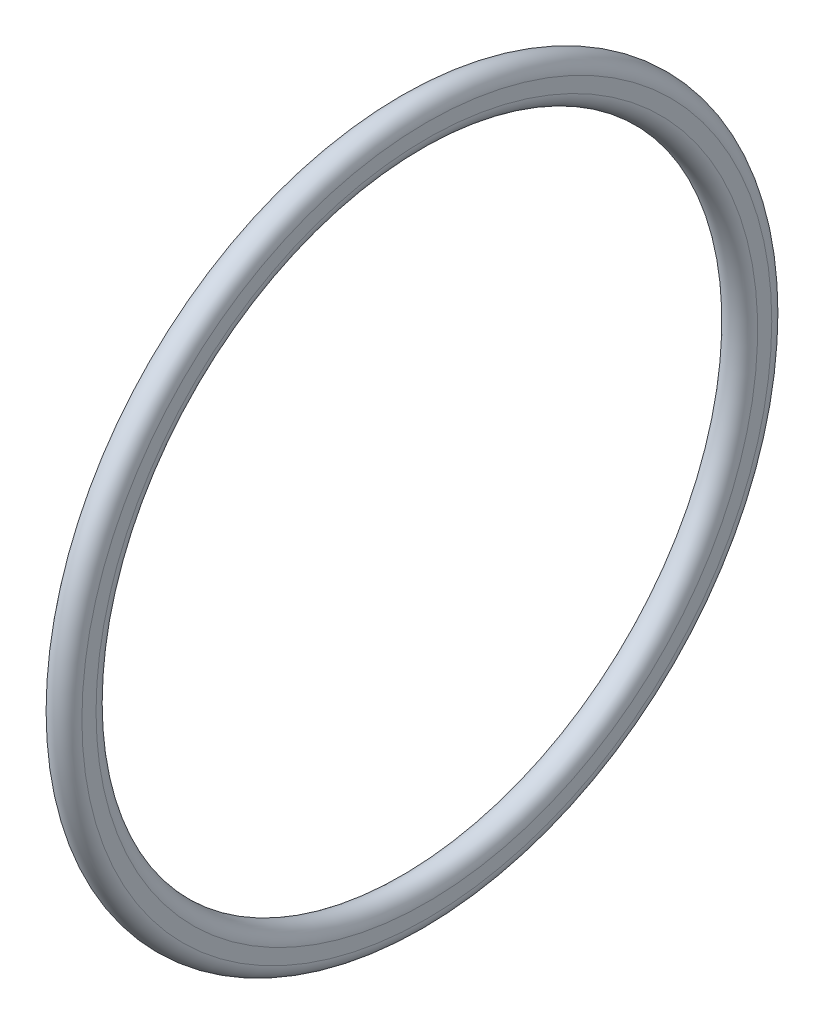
ISO-10303-21;
HEADER;
FILE_DESCRIPTION(('STEP AP214'),'2;1');
FILE_NAME('part.step','',(''),(''),'','','');
FILE_SCHEMA(('AUTOMOTIVE_DESIGN { 1 0 10303 214 1 1 1 1 }'));
ENDSEC;
DATA;
#1=APPLICATION_CONTEXT('core data for automotive mechanical design processes');
#2=APPLICATION_PROTOCOL_DEFINITION('international standard','automotive_design',2000,#1);
#3=PRODUCT_CONTEXT('',#1,'mechanical');
#4=PRODUCT('Part','Part','',(#3));
#5=PRODUCT_RELATED_PRODUCT_CATEGORY('part','',(#4));
#6=PRODUCT_DEFINITION_FORMATION('','',#4);
#7=PRODUCT_DEFINITION_CONTEXT('part definition',#1,'design');
#8=PRODUCT_DEFINITION('design','',#6,#7);
#9=PRODUCT_DEFINITION_SHAPE('','',#8);
#10=(LENGTH_UNIT() NAMED_UNIT(*) SI_UNIT(.MILLI.,.METRE.));
#11=(NAMED_UNIT(*) PLANE_ANGLE_UNIT() SI_UNIT($,.RADIAN.));
#12=(NAMED_UNIT(*) SI_UNIT($,.STERADIAN.) SOLID_ANGLE_UNIT());
#13=UNCERTAINTY_MEASURE_WITH_UNIT(LENGTH_MEASURE(1.E-05),#10,'distance_accuracy_value','');
#14=(GEOMETRIC_REPRESENTATION_CONTEXT(3) GLOBAL_UNCERTAINTY_ASSIGNED_CONTEXT((#13)) GLOBAL_UNIT_ASSIGNED_CONTEXT((#10,
#11,#12)) REPRESENTATION_CONTEXT('',''));
#15=CARTESIAN_POINT('',(0.,0.,0.));
#16=DIRECTION('',(0.,0.,1.));
#17=DIRECTION('',(1.,0.,0.));
#18=AXIS2_PLACEMENT_3D('',#15,#16,#17);
#19=CARTESIAN_POINT('',(0.,0.,0.));
#20=DIRECTION('',(-1.,0.,0.));
#21=DIRECTION('',(0.,0.,1.));
#22=AXIS2_PLACEMENT_3D('',#19,#20,#21);
#23=TOROIDAL_SURFACE('',#22,31.0007,1.3335);
#24=CARTESIAN_POINT('',(-1.3335,0.,0.));
#25=DIRECTION('',(-1.,0.,0.));
#26=DIRECTION('',(0.,0.,1.));
#27=AXIS2_PLACEMENT_3D('',#24,#25,#26);
#28=CIRCLE('',#27,31.0007);
#29=CARTESIAN_POINT('',(-1.3335,0.,31.0007));
#30=VERTEX_POINT('',#29);
#31=EDGE_CURVE('E393',#30,#30,#28,.T.);
#32=ORIENTED_EDGE('',*,*,#31,.F.);
#33=EDGE_LOOP('',(#32));
#34=FACE_BOUND('',#33,.T.);
#35=CARTESIAN_POINT('',(1.3335,0.,0.));
#36=DIRECTION('',(-1.,0.,0.));
#37=DIRECTION('',(0.,0.,1.));
#38=AXIS2_PLACEMENT_3D('',#35,#36,#37);
#39=CIRCLE('',#38,31.0007);
#40=CARTESIAN_POINT('',(1.3335,0.,31.0007));
#41=VERTEX_POINT('',#40);
#42=EDGE_CURVE('E10',#41,#41,#39,.T.);
#43=ORIENTED_EDGE('',*,*,#42,.T.);
#44=EDGE_LOOP('',(#43));
#45=FACE_BOUND('',#44,.T.);
#46=ADVANCED_FACE('F379',(#34,#45),#23,.T.);
#47=CARTESIAN_POINT('',(1.3335,31.0007,0.));
#48=DIRECTION('',(-1.,0.,0.));
#49=DIRECTION('',(0.,0.,1.));
#50=AXIS2_PLACEMENT_3D('',#47,#48,#49);
#51=PLANE('',#50);
#52=ORIENTED_EDGE('',*,*,#42,.F.);
#53=EDGE_LOOP('',(#52));
#54=FACE_BOUND('',#53,.T.);
#55=CARTESIAN_POINT('',(1.3335,0.,0.));
#56=DIRECTION('',(-1.,0.,0.));
#57=DIRECTION('',(0.,0.,1.));
#58=AXIS2_PLACEMENT_3D('',#55,#56,#57);
#59=CIRCLE('',#58,29.7307);
#60=CARTESIAN_POINT('',(1.3335,0.,29.7307));
#61=VERTEX_POINT('',#60);
#62=EDGE_CURVE('E385',#61,#61,#59,.T.);
#63=ORIENTED_EDGE('',*,*,#62,.T.);
#64=EDGE_LOOP('',(#63));
#65=FACE_BOUND('',#64,.T.);
#66=ADVANCED_FACE('F402',(#54,#65),#51,.F.);
#67=CARTESIAN_POINT('',(0.,0.,0.));
#68=DIRECTION('',(-1.,0.,0.));
#69=DIRECTION('',(0.,0.,1.));
#70=AXIS2_PLACEMENT_3D('',#67,#68,#69);
#71=TOROIDAL_SURFACE('',#70,29.7307,1.3335);
#72=ORIENTED_EDGE('',*,*,#62,.F.);
#73=EDGE_LOOP('',(#72));
#74=FACE_BOUND('',#73,.T.);
#75=CARTESIAN_POINT('',(-1.3335,0.,0.));
#76=DIRECTION('',(-1.,0.,0.));
#77=DIRECTION('',(0.,0.,1.));
#78=AXIS2_PLACEMENT_3D('',#75,#76,#77);
#79=CIRCLE('',#78,29.7307);
#80=CARTESIAN_POINT('',(-1.3335,0.,29.7307));
#81=VERTEX_POINT('',#80);
#82=EDGE_CURVE('E389',#81,#81,#79,.T.);
#83=ORIENTED_EDGE('',*,*,#82,.T.);
#84=EDGE_LOOP('',(#83));
#85=FACE_BOUND('',#84,.T.);
#86=ADVANCED_FACE('F406',(#74,#85),#71,.T.);
#87=CARTESIAN_POINT('',(-1.3335,31.0007,0.));
#88=DIRECTION('',(1.,0.,0.));
#89=DIRECTION('',(0.,0.,-1.));
#90=AXIS2_PLACEMENT_3D('',#87,#88,#89);
#91=PLANE('',#90);
#92=ORIENTED_EDGE('',*,*,#82,.F.);
#93=EDGE_LOOP('',(#92));
#94=FACE_BOUND('',#93,.T.);
#95=ORIENTED_EDGE('',*,*,#31,.T.);
#96=EDGE_LOOP('',(#95));
#97=FACE_BOUND('',#96,.T.);
#98=ADVANCED_FACE('F399',(#94,#97),#91,.F.);
#99=CLOSED_SHELL('',(#46,#66,#86,#98));
#100=MANIFOLD_SOLID_BREP('B2',#99);
#101=ADVANCED_BREP_SHAPE_REPRESENTATION('',(#18,#100),#14);
#102=SHAPE_DEFINITION_REPRESENTATION(#9,#101);
ENDSEC;
END-ISO-10303-21;
